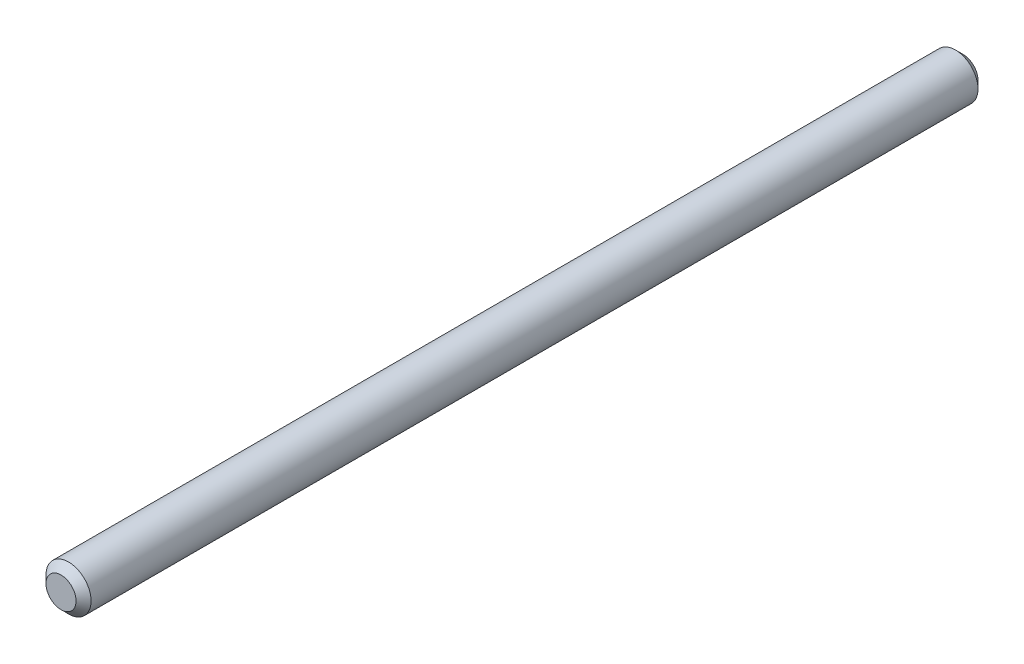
from build123d import *

# Parameters (mm, degrees)
ESQUISSE1_R      = 1.5
EXTRUSION1_DEPTH = 60
CHANFREIN1_SIZE  = 0.5


with BuildPart() as part:
    # Esquisse1 → Extrusion1 (new body)
    with BuildSketch(Plane.XY):
        Circle(ESQUISSE1_R)
    extrude(amount=EXTRUSION1_DEPTH)

    # Chanfrein1
    chanfrein1_edges = [part.edges().sort_by_distance(p)[0] for p in [
        (-1.5, 0, 0),
        (-1.5, 0, 60),
    ]]
    chamfer(chanfrein1_edges, length=CHANFREIN1_SIZE)


solid = part.part
